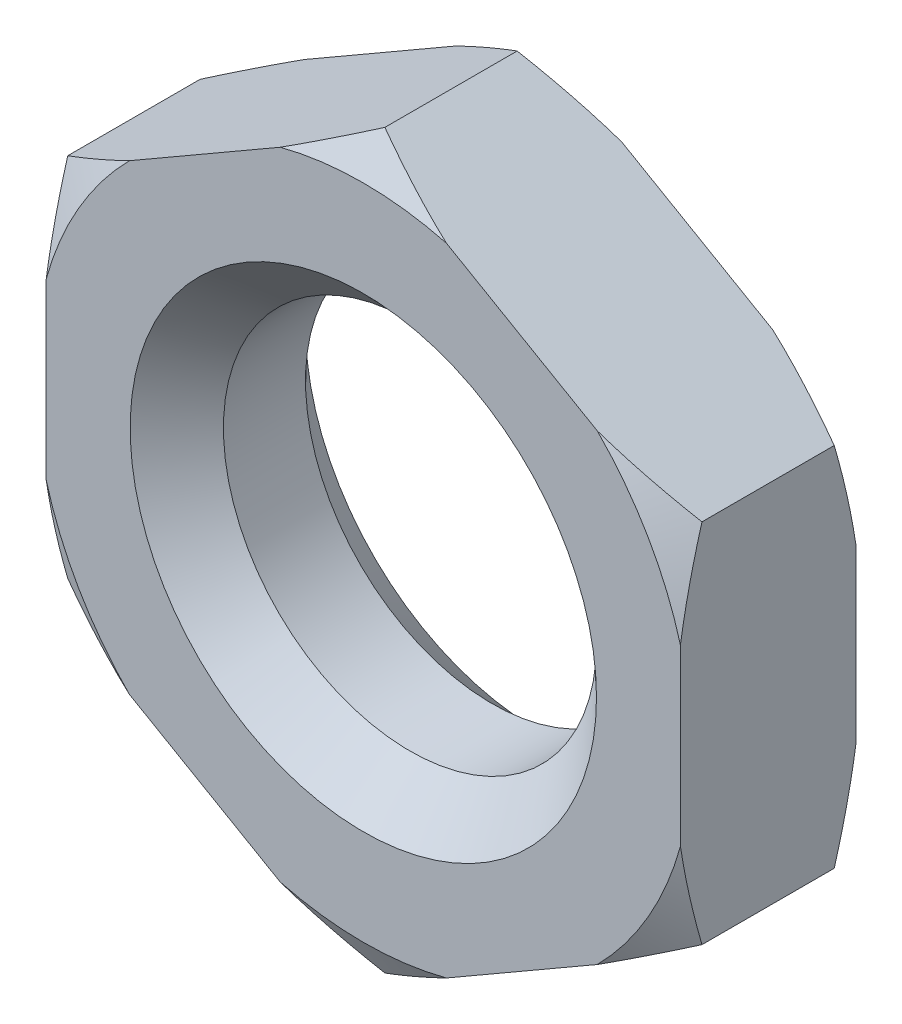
from build123d import *

# Parameters (mm, degrees)
SKETCH1_R           = 5
BOSS_EXTRUDE1_DEPTH = 2.35
CHAMFER1_SIZE       = 1.25


with BuildPart() as part:
    # Sketch1 → Boss-Extrude1 (new, symmetric)
    with BuildSketch(Plane.XY):
        Polygon((0, 9.814954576), (-8.5, 4.907477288), (-8.5, -4.907477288), (0, -9.814954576), (8.5, -4.907477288), (8.5, 4.907477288), align=None)
        Circle(SKETCH1_R, mode=Mode.SUBTRACT)
    extrude(amount=BOSS_EXTRUDE1_DEPTH, both=True)

    # Sketch3 → Cut-Revolve1 (revolve, cut)
    with BuildSketch(Plane(origin=(0, 0, 0), x_dir=(0, 0, -1), z_dir=(1, 0, 0))):
        Polygon((-2.35, 9.814954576), (-2.35, 8.814954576), (-1.772649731, 9.814954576), align=None)
    cut_revolve1 = revolve(axis=Axis((0, 0, -7.477018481), (0, 0, 1)), mode=Mode.SUBTRACT)

    # Mirror1: Cut-Revolve1 across plane
    add(cut_revolve1.mirror(Plane.XY), mode=Mode.SUBTRACT)

    # Chamfer1
    chamfer1_edges = [part.edges().sort_by_distance(p)[0] for p in [
        (-5, 0, -2.35),
        (-5, 0, 2.35),
    ]]
    chamfer(chamfer1_edges, length=CHAMFER1_SIZE)


solid = part.part
